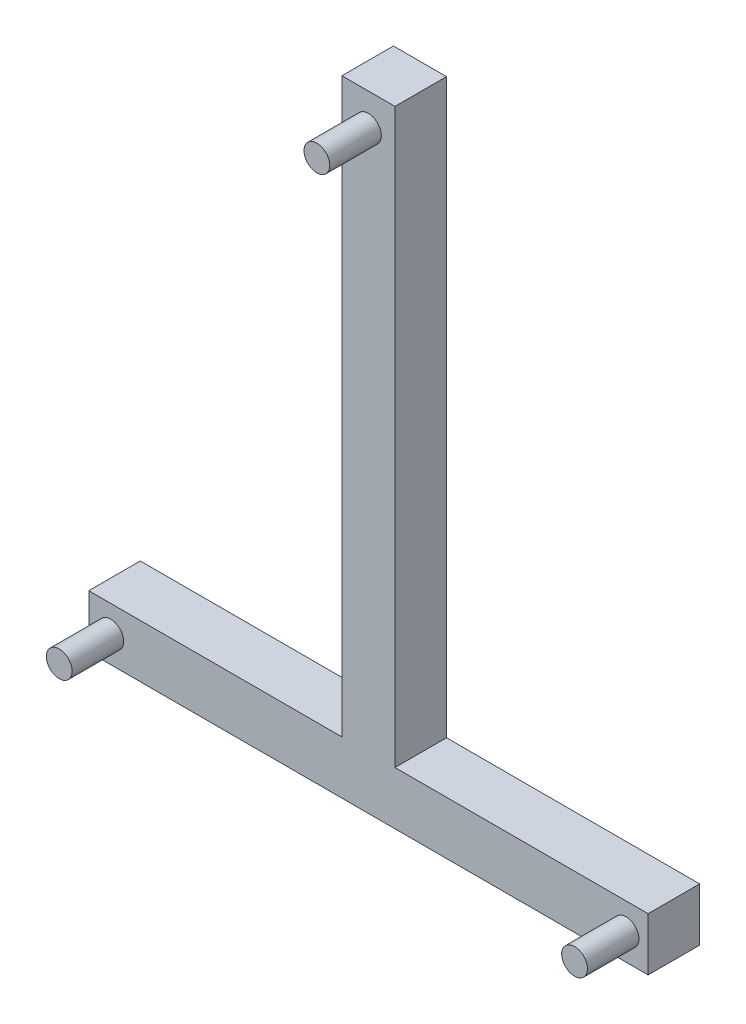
from build123d import *

# Parameters (mm, degrees)
SKETCH1_R           = 6.35
BOSS_EXTRUDE1_DEPTH = 25.4
SKETCH1_2_R         = 6.35
BOSS_EXTRUDE2_DEPTH = 25.4


with BuildPart() as part:
    # Sketch1 → Boss-Extrude1 (new body)
    with BuildSketch(Plane.XY):
        Polygon((-137.843347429, -13.078138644), (137.843347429, -13.078138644), (137.843347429, 13.078138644), (13.078138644, 13.078138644), (13.078138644, 295.274422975), (-13.078138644, 295.274422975), (-13.078138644, 13.078138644), (-137.843347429, 13.078138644), align=None)
        with Locations((-127, 0)):
            Circle(SKETCH1_R, mode=Mode.SUBTRACT)
        with Locations((127, 0)):
            Circle(SKETCH1_R, mode=Mode.SUBTRACT)
        with Locations((0, 279.4)):
            Circle(SKETCH1_R, mode=Mode.SUBTRACT)
    extrude(amount=-BOSS_EXTRUDE1_DEPTH)

    # Sketch1_2 → Boss-Extrude2 (add, symmetric)
    with BuildSketch(Plane.XY):
        with Locations((0, 279.4)):
            Circle(SKETCH1_2_R)
        with Locations((-127, 0)):
            Circle(SKETCH1_2_R)
        with Locations((127, 0)):
            Circle(SKETCH1_2_R)
    extrude(amount=BOSS_EXTRUDE2_DEPTH, both=True)


solid = part.part
